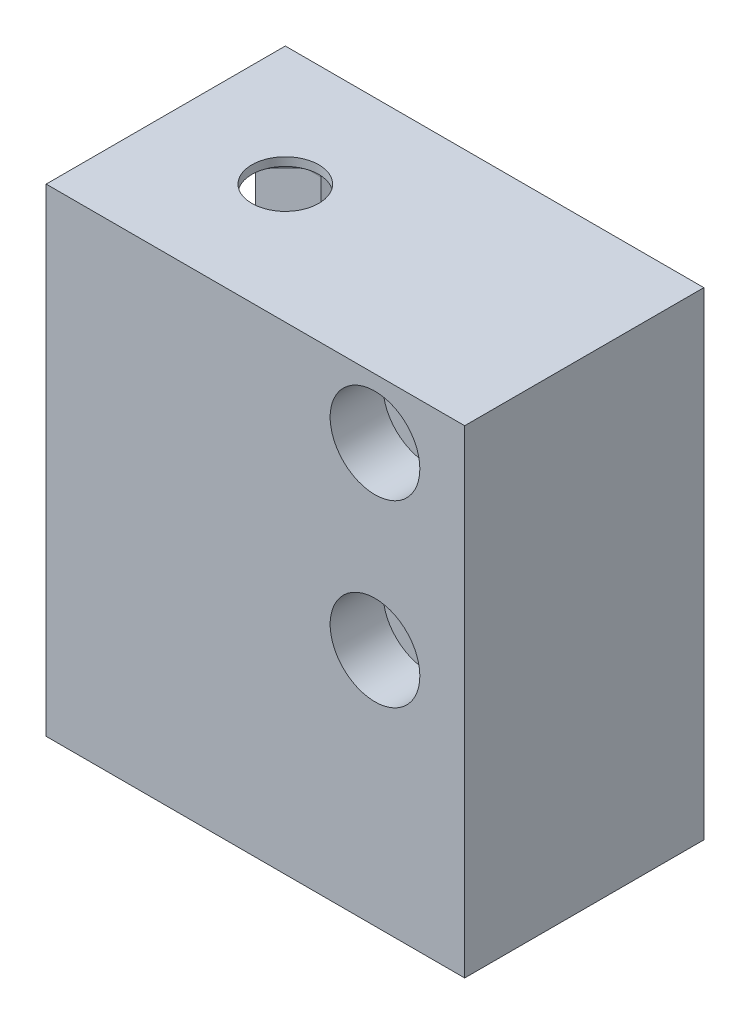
ISO-10303-21;
HEADER;
FILE_DESCRIPTION(('STEP AP214'),'2;1');
FILE_NAME('part.step','',(''),(''),'','','');
FILE_SCHEMA(('AUTOMOTIVE_DESIGN { 1 0 10303 214 1 1 1 1 }'));
ENDSEC;
DATA;
#1=APPLICATION_CONTEXT('core data for automotive mechanical design processes');
#2=APPLICATION_PROTOCOL_DEFINITION('international standard','automotive_design',2000,#1);
#3=PRODUCT_CONTEXT('',#1,'mechanical');
#4=PRODUCT('Part','Part','',(#3));
#5=PRODUCT_RELATED_PRODUCT_CATEGORY('part','',(#4));
#6=PRODUCT_DEFINITION_FORMATION('','',#4);
#7=PRODUCT_DEFINITION_CONTEXT('part definition',#1,'design');
#8=PRODUCT_DEFINITION('design','',#6,#7);
#9=PRODUCT_DEFINITION_SHAPE('','',#8);
#10=(LENGTH_UNIT() NAMED_UNIT(*) SI_UNIT(.MILLI.,.METRE.));
#11=(NAMED_UNIT(*) PLANE_ANGLE_UNIT() SI_UNIT($,.RADIAN.));
#12=(NAMED_UNIT(*) SI_UNIT($,.STERADIAN.) SOLID_ANGLE_UNIT());
#13=UNCERTAINTY_MEASURE_WITH_UNIT(LENGTH_MEASURE(1.E-05),#10,'distance_accuracy_value','');
#14=(GEOMETRIC_REPRESENTATION_CONTEXT(3) GLOBAL_UNCERTAINTY_ASSIGNED_CONTEXT((#13)) GLOBAL_UNIT_ASSIGNED_CONTEXT((#10,
#11,#12)) REPRESENTATION_CONTEXT('',''));
#15=CARTESIAN_POINT('',(0.,0.,0.));
#16=DIRECTION('',(0.,0.,1.));
#17=DIRECTION('',(1.,0.,0.));
#18=AXIS2_PLACEMENT_3D('',#15,#16,#17);
#19=CARTESIAN_POINT('',(22.225,50.8,12.7));
#20=DIRECTION('',(-1.,0.,0.));
#21=DIRECTION('',(0.,0.,1.));
#22=AXIS2_PLACEMENT_3D('',#19,#20,#21);
#23=PLANE('',#22);
#24=DIRECTION('',(0.,0.,-1.));
#25=VECTOR('',#24,1.);
#26=CARTESIAN_POINT('',(22.225,0.,12.7));
#27=LINE('',#26,#25);
#28=CARTESIAN_POINT('',(22.225,0.,12.7));
#29=VERTEX_POINT('',#28);
#30=CARTESIAN_POINT('',(22.225,0.,-12.7));
#31=VERTEX_POINT('',#30);
#32=EDGE_CURVE('E225',#29,#31,#27,.T.);
#33=ORIENTED_EDGE('',*,*,#32,.T.);
#34=DIRECTION('',(0.,-1.,0.));
#35=VECTOR('',#34,1.);
#36=CARTESIAN_POINT('',(22.225,50.8,-12.7));
#37=LINE('',#36,#35);
#38=CARTESIAN_POINT('',(22.225,50.8,-12.7));
#39=VERTEX_POINT('',#38);
#40=EDGE_CURVE('E171',#39,#31,#37,.T.);
#41=ORIENTED_EDGE('',*,*,#40,.F.);
#42=DIRECTION('',(0.,0.,-1.));
#43=VECTOR('',#42,1.);
#44=CARTESIAN_POINT('',(22.225,50.8,12.7));
#45=LINE('',#44,#43);
#46=CARTESIAN_POINT('',(22.225,50.8,12.7));
#47=VERTEX_POINT('',#46);
#48=EDGE_CURVE('E157',#47,#39,#45,.T.);
#49=ORIENTED_EDGE('',*,*,#48,.F.);
#50=DIRECTION('',(0.,-1.,0.));
#51=VECTOR('',#50,1.);
#52=CARTESIAN_POINT('',(22.225,50.8,12.7));
#53=LINE('',#52,#51);
#54=EDGE_CURVE('E163',#47,#29,#53,.T.);
#55=ORIENTED_EDGE('',*,*,#54,.T.);
#56=EDGE_LOOP('',(#33,#41,#49,#55));
#57=FACE_BOUND('',#56,.T.);
#58=ADVANCED_FACE('F32',(#57),#23,.F.);
#59=CARTESIAN_POINT('',(-22.225,50.8,-12.7));
#60=DIRECTION('',(0.,0.,1.));
#61=DIRECTION('',(1.,0.,0.));
#62=AXIS2_PLACEMENT_3D('',#59,#60,#61);
#63=PLANE('',#62);
#64=CARTESIAN_POINT('',(12.7,44.45,-12.7));
#65=DIRECTION('',(0.,0.,-1.));
#66=DIRECTION('',(-1.,0.,0.));
#67=AXIS2_PLACEMENT_3D('',#64,#65,#66);
#68=CIRCLE('',#67,4.76249999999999);
#69=CARTESIAN_POINT('',(7.9375,44.45,-12.7));
#70=VERTEX_POINT('',#69);
#71=EDGE_CURVE('E302',#70,#70,#68,.T.);
#72=ORIENTED_EDGE('',*,*,#71,.F.);
#73=EDGE_LOOP('',(#72));
#74=FACE_BOUND('',#73,.T.);
#75=CARTESIAN_POINT('',(12.7,25.4,-12.7));
#76=DIRECTION('',(0.,0.,-1.));
#77=DIRECTION('',(-1.,0.,0.));
#78=AXIS2_PLACEMENT_3D('',#75,#76,#77);
#79=CIRCLE('',#78,4.76249999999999);
#80=CARTESIAN_POINT('',(7.9375,25.4,-12.7));
#81=VERTEX_POINT('',#80);
#82=EDGE_CURVE('E293',#81,#81,#79,.T.);
#83=ORIENTED_EDGE('',*,*,#82,.F.);
#84=EDGE_LOOP('',(#83));
#85=FACE_BOUND('',#84,.T.);
#86=DIRECTION('',(-1.,0.,0.));
#87=VECTOR('',#86,1.);
#88=CARTESIAN_POINT('',(-22.225,0.,-12.7));
#89=LINE('',#88,#87);
#90=CARTESIAN_POINT('',(-22.225,0.,-12.7));
#91=VERTEX_POINT('',#90);
#92=EDGE_CURVE('E159',#31,#91,#89,.T.);
#93=ORIENTED_EDGE('',*,*,#92,.T.);
#94=DIRECTION('',(0.,-1.,0.));
#95=VECTOR('',#94,1.);
#96=CARTESIAN_POINT('',(-22.225,50.8,-12.7));
#97=LINE('',#96,#95);
#98=CARTESIAN_POINT('',(-22.225,50.8,-12.7));
#99=VERTEX_POINT('',#98);
#100=EDGE_CURVE('E153',#99,#91,#97,.T.);
#101=ORIENTED_EDGE('',*,*,#100,.F.);
#102=DIRECTION('',(-1.,0.,0.));
#103=VECTOR('',#102,1.);
#104=CARTESIAN_POINT('',(-22.225,50.8,-12.7));
#105=LINE('',#104,#103);
#106=EDGE_CURVE('E237',#39,#99,#105,.T.);
#107=ORIENTED_EDGE('',*,*,#106,.F.);
#108=ORIENTED_EDGE('',*,*,#40,.T.);
#109=EDGE_LOOP('',(#93,#101,#107,#108));
#110=FACE_BOUND('',#109,.T.);
#111=ADVANCED_FACE('F216',(#74,#85,#110),#63,.F.);
#112=CARTESIAN_POINT('',(-22.225,50.8,12.7));
#113=DIRECTION('',(1.,0.,0.));
#114=DIRECTION('',(0.,0.,-1.));
#115=AXIS2_PLACEMENT_3D('',#112,#113,#114);
#116=PLANE('',#115);
#117=DIRECTION('',(0.,0.,-1.));
#118=VECTOR('',#117,1.);
#119=CARTESIAN_POINT('',(-22.225,44.45,-9.525));
#120=LINE('',#119,#118);
#121=CARTESIAN_POINT('',(-22.225,44.45,8.89));
#122=VERTEX_POINT('',#121);
#123=CARTESIAN_POINT('',(-22.225,44.45,-8.89));
#124=VERTEX_POINT('',#123);
#125=EDGE_CURVE('E146',#122,#124,#120,.T.);
#126=ORIENTED_EDGE('',*,*,#125,.F.);
#127=CARTESIAN_POINT('',(-22.225,43.815,8.89));
#128=DIRECTION('',(1.,0.,0.));
#129=DIRECTION('',(0.,0.,-1.));
#130=AXIS2_PLACEMENT_3D('',#127,#128,#129);
#131=CIRCLE('',#130,0.635);
#132=CARTESIAN_POINT('',(-22.225,43.815,9.525));
#133=VERTEX_POINT('',#132);
#134=EDGE_CURVE('E190',#122,#133,#131,.T.);
#135=ORIENTED_EDGE('',*,*,#134,.T.);
#136=DIRECTION('',(0.,1.,0.));
#137=VECTOR('',#136,1.);
#138=CARTESIAN_POINT('',(-22.225,0.,9.52500000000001));
#139=LINE('',#138,#137);
#140=CARTESIAN_POINT('',(-22.225,0.,9.52500000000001));
#141=VERTEX_POINT('',#140);
#142=EDGE_CURVE('E134',#141,#133,#139,.T.);
#143=ORIENTED_EDGE('',*,*,#142,.F.);
#144=DIRECTION('',(0.,0.,1.));
#145=VECTOR('',#144,1.);
#146=CARTESIAN_POINT('',(-22.225,0.,12.7));
#147=LINE('',#146,#145);
#148=CARTESIAN_POINT('',(-22.225,0.,12.7));
#149=VERTEX_POINT('',#148);
#150=EDGE_CURVE('E155',#141,#149,#147,.T.);
#151=ORIENTED_EDGE('',*,*,#150,.T.);
#152=DIRECTION('',(0.,-1.,0.));
#153=VECTOR('',#152,1.);
#154=CARTESIAN_POINT('',(-22.225,50.8,12.7));
#155=LINE('',#154,#153);
#156=CARTESIAN_POINT('',(-22.225,50.8,12.7));
#157=VERTEX_POINT('',#156);
#158=EDGE_CURVE('E166',#157,#149,#155,.T.);
#159=ORIENTED_EDGE('',*,*,#158,.F.);
#160=DIRECTION('',(0.,0.,1.));
#161=VECTOR('',#160,1.);
#162=CARTESIAN_POINT('',(-22.225,50.8,12.7));
#163=LINE('',#162,#161);
#164=EDGE_CURVE('E235',#99,#157,#163,.T.);
#165=ORIENTED_EDGE('',*,*,#164,.F.);
#166=ORIENTED_EDGE('',*,*,#100,.T.);
#167=CARTESIAN_POINT('',(-22.225,0.,-9.525));
#168=VERTEX_POINT('',#167);
#169=EDGE_CURVE('E142',#91,#168,#147,.T.);
#170=ORIENTED_EDGE('',*,*,#169,.T.);
#171=DIRECTION('',(0.,-1.,0.));
#172=VECTOR('',#171,1.);
#173=CARTESIAN_POINT('',(-22.225,0.,-9.525));
#174=LINE('',#173,#172);
#175=CARTESIAN_POINT('',(-22.225,43.815,-9.525));
#176=VERTEX_POINT('',#175);
#177=EDGE_CURVE('E127',#176,#168,#174,.T.);
#178=ORIENTED_EDGE('',*,*,#177,.F.);
#179=CARTESIAN_POINT('',(-22.225,43.815,-8.89));
#180=DIRECTION('',(1.,0.,0.));
#181=DIRECTION('',(0.,0.,-1.));
#182=AXIS2_PLACEMENT_3D('',#179,#180,#181);
#183=CIRCLE('',#182,0.635);
#184=EDGE_CURVE('E44',#176,#124,#183,.T.);
#185=ORIENTED_EDGE('',*,*,#184,.T.);
#186=EDGE_LOOP('',(#126,#135,#143,#151,#159,#165,#166,#170,#178,#185));
#187=FACE_BOUND('',#186,.T.);
#188=ADVANCED_FACE('F150',(#187),#116,.F.);
#189=CARTESIAN_POINT('',(-22.225,50.8,12.7));
#190=DIRECTION('',(0.,0.,-1.));
#191=DIRECTION('',(-1.,0.,0.));
#192=AXIS2_PLACEMENT_3D('',#189,#190,#191);
#193=PLANE('',#192);
#194=CARTESIAN_POINT('',(12.7,25.4,12.7));
#195=DIRECTION('',(0.,0.,1.));
#196=DIRECTION('',(1.,0.,0.));
#197=AXIS2_PLACEMENT_3D('',#194,#195,#196);
#198=CIRCLE('',#197,4.76249999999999);
#199=CARTESIAN_POINT('',(17.4625,25.4,12.7));
#200=VERTEX_POINT('',#199);
#201=EDGE_CURVE('E284',#200,#200,#198,.T.);
#202=ORIENTED_EDGE('',*,*,#201,.F.);
#203=EDGE_LOOP('',(#202));
#204=FACE_BOUND('',#203,.T.);
#205=CARTESIAN_POINT('',(12.7,44.45,12.7));
#206=DIRECTION('',(0.,0.,1.));
#207=DIRECTION('',(1.,0.,0.));
#208=AXIS2_PLACEMENT_3D('',#205,#206,#207);
#209=CIRCLE('',#208,4.76249999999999);
#210=CARTESIAN_POINT('',(17.4625,44.45,12.7));
#211=VERTEX_POINT('',#210);
#212=EDGE_CURVE('E275',#211,#211,#209,.T.);
#213=ORIENTED_EDGE('',*,*,#212,.F.);
#214=EDGE_LOOP('',(#213));
#215=FACE_BOUND('',#214,.T.);
#216=DIRECTION('',(1.,0.,0.));
#217=VECTOR('',#216,1.);
#218=CARTESIAN_POINT('',(-22.225,0.,12.7));
#219=LINE('',#218,#217);
#220=EDGE_CURVE('E154',#149,#29,#219,.T.);
#221=ORIENTED_EDGE('',*,*,#220,.T.);
#222=ORIENTED_EDGE('',*,*,#54,.F.);
#223=DIRECTION('',(1.,0.,0.));
#224=VECTOR('',#223,1.);
#225=CARTESIAN_POINT('',(-22.225,50.8,12.7));
#226=LINE('',#225,#224);
#227=EDGE_CURVE('E167',#157,#47,#226,.T.);
#228=ORIENTED_EDGE('',*,*,#227,.F.);
#229=ORIENTED_EDGE('',*,*,#158,.T.);
#230=EDGE_LOOP('',(#221,#222,#228,#229));
#231=FACE_BOUND('',#230,.T.);
#232=ADVANCED_FACE('F389',(#204,#215,#231),#193,.F.);
#233=CARTESIAN_POINT('',(22.225,50.8,-12.7));
#234=DIRECTION('',(0.,-1.,0.));
#235=DIRECTION('',(0.,0.,-1.));
#236=AXIS2_PLACEMENT_3D('',#233,#234,#235);
#237=PLANE('',#236);
#238=CARTESIAN_POINT('',(-9.52500000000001,50.8,0.));
#239=DIRECTION('',(0.,-1.,0.));
#240=DIRECTION('',(0.,0.,-1.));
#241=AXIS2_PLACEMENT_3D('',#238,#239,#240);
#242=CIRCLE('',#241,3.556);
#243=CARTESIAN_POINT('',(-9.52500000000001,50.8,-3.556));
#244=VERTEX_POINT('',#243);
#245=EDGE_CURVE('E305',#244,#244,#242,.T.);
#246=ORIENTED_EDGE('',*,*,#245,.T.);
#247=EDGE_LOOP('',(#246));
#248=FACE_BOUND('',#247,.T.);
#249=ORIENTED_EDGE('',*,*,#48,.T.);
#250=ORIENTED_EDGE('',*,*,#106,.T.);
#251=ORIENTED_EDGE('',*,*,#164,.T.);
#252=ORIENTED_EDGE('',*,*,#227,.T.);
#253=EDGE_LOOP('',(#249,#250,#251,#252));
#254=FACE_BOUND('',#253,.T.);
#255=ADVANCED_FACE('F312',(#248,#254),#237,.F.);
#256=CARTESIAN_POINT('',(22.225,0.,-12.7));
#257=DIRECTION('',(0.,-1.,0.));
#258=DIRECTION('',(0.,0.,-1.));
#259=AXIS2_PLACEMENT_3D('',#256,#257,#258);
#260=PLANE('',#259);
#261=DIRECTION('',(-1.,0.,0.));
#262=VECTOR('',#261,1.);
#263=CARTESIAN_POINT('',(22.226,0.,9.52500000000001));
#264=LINE('',#263,#262);
#265=CARTESIAN_POINT('',(-15.2488126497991,0.,9.52500000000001));
#266=VERTEX_POINT('',#265);
#267=EDGE_CURVE('E145',#266,#141,#264,.T.);
#268=ORIENTED_EDGE('',*,*,#267,.F.);
#269=CARTESIAN_POINT('',(-9.52500000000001,0.,0.));
#270=DIRECTION('',(0.,-1.,0.));
#271=DIRECTION('',(0.,0.,-1.));
#272=AXIS2_PLACEMENT_3D('',#269,#270,#271);
#273=CIRCLE('',#272,11.1125);
#274=CARTESIAN_POINT('',(1.14974476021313,0.,3.08828116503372));
#275=VERTEX_POINT('',#274);
#276=EDGE_CURVE('E255',#275,#266,#273,.T.);
#277=ORIENTED_EDGE('',*,*,#276,.F.);
#278=CARTESIAN_POINT('',(4.77519999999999,0.,0.));
#279=DIRECTION('',(0.,-1.,0.));
#280=DIRECTION('',(0.,0.,-1.));
#281=AXIS2_PLACEMENT_3D('',#278,#279,#280);
#282=CIRCLE('',#281,4.7625);
#283=CARTESIAN_POINT('',(1.14974476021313,0.,-3.08828116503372));
#284=VERTEX_POINT('',#283);
#285=EDGE_CURVE('E231',#284,#275,#282,.T.);
#286=ORIENTED_EDGE('',*,*,#285,.F.);
#287=CARTESIAN_POINT('',(-15.2488126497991,0.,-9.525));
#288=VERTEX_POINT('',#287);
#289=EDGE_CURVE('E144',#288,#284,#273,.T.);
#290=ORIENTED_EDGE('',*,*,#289,.F.);
#291=DIRECTION('',(-1.,0.,0.));
#292=VECTOR('',#291,1.);
#293=CARTESIAN_POINT('',(22.226,0.,-9.525));
#294=LINE('',#293,#292);
#295=EDGE_CURVE('E130',#288,#168,#294,.T.);
#296=ORIENTED_EDGE('',*,*,#295,.T.);
#297=ORIENTED_EDGE('',*,*,#169,.F.);
#298=ORIENTED_EDGE('',*,*,#92,.F.);
#299=ORIENTED_EDGE('',*,*,#32,.F.);
#300=ORIENTED_EDGE('',*,*,#220,.F.);
#301=ORIENTED_EDGE('',*,*,#150,.F.);
#302=EDGE_LOOP('',(#268,#277,#286,#290,#296,#297,#298,#299,#300,#301));
#303=FACE_BOUND('',#302,.T.);
#304=ADVANCED_FACE('F141',(#303),#260,.T.);
#305=CARTESIAN_POINT('',(4.77519999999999,3.175,0.));
#306=DIRECTION('',(0.,-1.,0.));
#307=DIRECTION('',(0.,0.,-1.));
#308=AXIS2_PLACEMENT_3D('',#305,#306,#307);
#309=CYLINDRICAL_SURFACE('',#308,4.7625);
#310=CARTESIAN_POINT('',(4.77519999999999,3.175,0.));
#311=DIRECTION('',(0.,-1.,0.));
#312=DIRECTION('',(0.,0.,-1.));
#313=AXIS2_PLACEMENT_3D('',#310,#311,#312);
#314=CIRCLE('',#313,4.7625);
#315=CARTESIAN_POINT('',(1.14974476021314,3.175,-3.08828116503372));
#316=VERTEX_POINT('',#315);
#317=CARTESIAN_POINT('',(1.14974476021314,3.175,3.08828116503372));
#318=VERTEX_POINT('',#317);
#319=EDGE_CURVE('E229',#316,#318,#314,.T.);
#320=ORIENTED_EDGE('',*,*,#319,.F.);
#321=DIRECTION('',(0.,-1.,0.));
#322=VECTOR('',#321,1.);
#323=CARTESIAN_POINT('',(1.14974476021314,24.9555,-3.08828116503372));
#324=LINE('',#323,#322);
#325=EDGE_CURVE('E249',#316,#284,#324,.T.);
#326=ORIENTED_EDGE('',*,*,#325,.T.);
#327=ORIENTED_EDGE('',*,*,#285,.T.);
#328=DIRECTION('',(0.,-1.,0.));
#329=VECTOR('',#328,1.);
#330=CARTESIAN_POINT('',(1.14974476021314,24.9555,3.08828116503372));
#331=LINE('',#330,#329);
#332=EDGE_CURVE('E252',#275,#318,#331,.F.);
#333=ORIENTED_EDGE('',*,*,#332,.T.);
#334=EDGE_LOOP('',(#320,#326,#327,#333));
#335=FACE_BOUND('',#334,.T.);
#336=ADVANCED_FACE('F399',(#335),#309,.F.);
#337=CARTESIAN_POINT('',(4.77519999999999,3.175,0.));
#338=DIRECTION('',(0.,-1.,0.));
#339=DIRECTION('',(0.,0.,-1.));
#340=AXIS2_PLACEMENT_3D('',#337,#338,#339);
#341=PLANE('',#340);
#342=CARTESIAN_POINT('',(-9.52500000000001,3.175,0.));
#343=DIRECTION('',(0.,-1.,0.));
#344=DIRECTION('',(0.,0.,-1.));
#345=AXIS2_PLACEMENT_3D('',#342,#343,#344);
#346=CIRCLE('',#345,11.1125);
#347=EDGE_CURVE('E174',#316,#318,#346,.T.);
#348=ORIENTED_EDGE('',*,*,#347,.F.);
#349=ORIENTED_EDGE('',*,*,#319,.T.);
#350=EDGE_LOOP('',(#348,#349));
#351=FACE_BOUND('',#350,.T.);
#352=CARTESIAN_POINT('',(4.77519999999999,3.175,0.));
#353=DIRECTION('',(0.,-1.,0.));
#354=DIRECTION('',(0.,0.,-1.));
#355=AXIS2_PLACEMENT_3D('',#352,#353,#354);
#356=CIRCLE('',#355,2.413);
#357=CARTESIAN_POINT('',(4.77519999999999,3.175,-2.413));
#358=VERTEX_POINT('',#357);
#359=EDGE_CURVE('E246',#358,#358,#356,.T.);
#360=ORIENTED_EDGE('',*,*,#359,.F.);
#361=EDGE_LOOP('',(#360));
#362=FACE_BOUND('',#361,.T.);
#363=ADVANCED_FACE('F402',(#351,#362),#341,.T.);
#364=CARTESIAN_POINT('',(4.77519999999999,17.399,0.));
#365=DIRECTION('',(0.,-1.,0.));
#366=DIRECTION('',(0.,0.,-1.));
#367=AXIS2_PLACEMENT_3D('',#364,#365,#366);
#368=CONICAL_SURFACE('',#367,2.413,1.02974425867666);
#369=CARTESIAN_POINT('',(4.77519999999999,18.8488766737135,0.));
#370=VERTEX_POINT('',#369);
#371=VERTEX_LOOP('',#370);
#372=FACE_BOUND('',#371,.T.);
#373=CARTESIAN_POINT('',(4.77519999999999,17.399,0.));
#374=DIRECTION('',(0.,-1.,0.));
#375=DIRECTION('',(0.,0.,-1.));
#376=AXIS2_PLACEMENT_3D('',#373,#374,#375);
#377=CIRCLE('',#376,2.413);
#378=CARTESIAN_POINT('',(4.77519999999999,17.399,-2.413));
#379=VERTEX_POINT('',#378);
#380=EDGE_CURVE('E242',#379,#379,#377,.T.);
#381=ORIENTED_EDGE('',*,*,#380,.T.);
#382=EDGE_LOOP('',(#381));
#383=FACE_BOUND('',#382,.T.);
#384=ADVANCED_FACE('F405',(#372,#383),#368,.F.);
#385=CARTESIAN_POINT('',(4.77519999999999,3.175,0.));
#386=DIRECTION('',(0.,-1.,0.));
#387=DIRECTION('',(0.,0.,-1.));
#388=AXIS2_PLACEMENT_3D('',#385,#386,#387);
#389=CYLINDRICAL_SURFACE('',#388,2.413);
#390=ORIENTED_EDGE('',*,*,#380,.F.);
#391=EDGE_LOOP('',(#390));
#392=FACE_BOUND('',#391,.T.);
#393=ORIENTED_EDGE('',*,*,#359,.T.);
#394=EDGE_LOOP('',(#393));
#395=FACE_BOUND('',#394,.T.);
#396=ADVANCED_FACE('F332',(#392,#395),#389,.F.);
#397=CARTESIAN_POINT('',(-9.52500000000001,49.911,0.));
#398=DIRECTION('',(0.,-1.,0.));
#399=DIRECTION('',(0.,0.,-1.));
#400=AXIS2_PLACEMENT_3D('',#397,#398,#399);
#401=CYLINDRICAL_SURFACE('',#400,11.1125);
#402=CARTESIAN_POINT('',(-9.52500000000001,49.276,0.));
#403=DIRECTION('',(0.,-1.,0.));
#404=DIRECTION('',(0.,0.,-1.));
#405=AXIS2_PLACEMENT_3D('',#402,#403,#404);
#406=CIRCLE('',#405,11.1125);
#407=CARTESIAN_POINT('',(-9.52500000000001,49.276,-11.1125));
#408=VERTEX_POINT('',#407);
#409=EDGE_CURVE('E187',#408,#408,#406,.F.);
#410=ORIENTED_EDGE('',*,*,#409,.T.);
#411=EDGE_LOOP('',(#410));
#412=FACE_BOUND('',#411,.T.);
#413=ORIENTED_EDGE('',*,*,#276,.T.);
#414=DIRECTION('',(0.,-1.,0.));
#415=VECTOR('',#414,1.);
#416=CARTESIAN_POINT('',(-15.2488126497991,49.911,9.525));
#417=LINE('',#416,#415);
#418=CARTESIAN_POINT('',(-15.2488126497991,43.815,9.525));
#419=VERTEX_POINT('',#418);
#420=EDGE_CURVE('E265',#419,#266,#417,.T.);
#421=ORIENTED_EDGE('',*,*,#420,.F.);
#422=CARTESIAN_POINT('',(-15.2488126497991,43.815,9.525));
#423=CARTESIAN_POINT('',(-15.2487686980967,43.8348857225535,9.52502473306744));
#424=CARTESIAN_POINT('',(-15.2503650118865,43.8547064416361,9.524067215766));
#425=CARTESIAN_POINT('',(-15.2564333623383,43.8935254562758,9.52041744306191));
#426=CARTESIAN_POINT('',(-15.2608739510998,43.9125303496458,9.51774415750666));
#427=CARTESIAN_POINT('',(-15.2736147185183,43.9539417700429,9.5100551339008));
#428=CARTESIAN_POINT('',(-15.2825881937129,43.9760607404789,9.50462948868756));
#429=CARTESIAN_POINT('',(-15.3034557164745,44.0183788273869,9.4919574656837));
#430=CARTESIAN_POINT('',(-15.3153629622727,44.038568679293,9.4847028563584));
#431=CARTESIAN_POINT('',(-15.3484722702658,44.0875864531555,9.46442700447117));
#432=CARTESIAN_POINT('',(-15.3711663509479,44.1149934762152,9.45043922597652));
#433=CARTESIAN_POINT('',(-15.4196090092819,44.1655346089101,9.4203005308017));
#434=CARTESIAN_POINT('',(-15.4453638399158,44.1886597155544,9.40414517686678));
#435=CARTESIAN_POINT('',(-15.4957422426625,44.2288351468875,9.37222917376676));
#436=CARTESIAN_POINT('',(-15.5201620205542,44.2462771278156,9.35663212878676));
#437=CARTESIAN_POINT('',(-15.5700344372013,44.278642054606,9.32448920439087));
#438=CARTESIAN_POINT('',(-15.5954878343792,44.293563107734,9.30794262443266));
#439=CARTESIAN_POINT('',(-15.6730432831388,44.335021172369,9.25705309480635));
#440=CARTESIAN_POINT('',(-15.7262176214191,44.3581608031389,9.22153791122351));
#441=CARTESIAN_POINT('',(-15.8141576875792,44.3895570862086,9.16165257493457));
#442=CARTESIAN_POINT('',(-15.8485789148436,44.4001652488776,9.13793114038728));
#443=CARTESIAN_POINT('',(-15.9177061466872,44.4183303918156,9.08970499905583));
#444=CARTESIAN_POINT('',(-15.9524122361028,44.4258864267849,9.06520005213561));
#445=CARTESIAN_POINT('',(-16.021441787,44.4379145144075,9.01585695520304));
#446=CARTESIAN_POINT('',(-16.0557645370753,44.4424243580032,8.99102693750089));
#447=CARTESIAN_POINT('',(-16.1242727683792,44.4484598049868,8.94086491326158));
#448=CARTESIAN_POINT('',(-16.1584583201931,44.4499872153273,8.91553322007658));
#449=CARTESIAN_POINT('',(-16.1925,44.45,8.89));
#450=B_SPLINE_CURVE_WITH_KNOTS('',3,(#422,#423,#424,#425,#426,#427,#428,#429,#430,#431,#432,
#433,#434,#435,#436,#437,#438,#439,#440,#441,#442,#443,#444,#445,#446,#447,#448,#449),
.UNSPECIFIED.,.F.,.F.,(4,2,2,2,2,2,2,2,2,2,2,2,2,4),(0.,0.0594650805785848,0.118283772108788,
0.191313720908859,0.264678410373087,0.378739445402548,0.493037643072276,0.594353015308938,
0.695744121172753,0.899037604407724,1.02833378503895,1.1576699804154,1.28537062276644,
1.41299387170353),.UNSPECIFIED.);
#451=CARTESIAN_POINT('',(-16.1925,44.45,8.89));
#452=VERTEX_POINT('',#451);
#453=EDGE_CURVE('E192',#419,#452,#450,.T.);
#454=ORIENTED_EDGE('',*,*,#453,.T.);
#455=CARTESIAN_POINT('',(-9.52500000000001,44.45,0.));
#456=DIRECTION('',(0.,1.,0.));
#457=DIRECTION('',(0.,0.,1.));
#458=AXIS2_PLACEMENT_3D('',#455,#456,#457);
#459=CIRCLE('',#458,11.1125);
#460=CARTESIAN_POINT('',(-16.1925,44.45,-8.89));
#461=VERTEX_POINT('',#460);
#462=EDGE_CURVE('E264',#461,#452,#459,.T.);
#463=ORIENTED_EDGE('',*,*,#462,.F.);
#464=CARTESIAN_POINT('',(-16.1925,44.45,-8.89));
#465=CARTESIAN_POINT('',(-16.1523787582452,44.4499750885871,-8.92009497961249));
#466=CARTESIAN_POINT('',(-16.1120540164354,44.4478599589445,-8.94991019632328));
#467=CARTESIAN_POINT('',(-16.0312183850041,44.4394972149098,-9.00884373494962));
#468=CARTESIAN_POINT('',(-15.9907072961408,44.4332426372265,-9.03796079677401));
#469=CARTESIAN_POINT('',(-15.9095256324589,44.4165813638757,-9.09549278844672));
#470=CARTESIAN_POINT('',(-15.8688564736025,44.4061410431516,-9.12390000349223));
#471=CARTESIAN_POINT('',(-15.7880840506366,44.3809749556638,-9.1795334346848));
#472=CARTESIAN_POINT('',(-15.7479802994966,44.3662531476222,-9.20676071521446));
#473=CARTESIAN_POINT('',(-15.6688830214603,44.3322173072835,-9.25973100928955));
#474=CARTESIAN_POINT('',(-15.6298871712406,44.3129138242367,-9.2854772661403));
#475=CARTESIAN_POINT('',(-15.5537039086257,44.2690832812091,-9.33511865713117));
#476=CARTESIAN_POINT('',(-15.5165139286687,44.2445639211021,-9.35901644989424));
#477=CARTESIAN_POINT('',(-15.4539207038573,44.1959541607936,-9.3987543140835));
#478=CARTESIAN_POINT('',(-15.4278423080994,44.1731945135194,-9.41514523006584));
#479=CARTESIAN_POINT('',(-15.3786055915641,44.1234258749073,-9.44583453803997));
#480=CARTESIAN_POINT('',(-15.3554421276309,44.0964245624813,-9.46013662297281));
#481=CARTESIAN_POINT('',(-15.3219594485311,44.0489178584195,-9.48067221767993));
#482=CARTESIAN_POINT('',(-15.3101289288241,44.0299147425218,-9.48789200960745));
#483=CARTESIAN_POINT('',(-15.2890144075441,43.9901153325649,-9.50073388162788));
#484=CARTESIAN_POINT('',(-15.279719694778,43.9693270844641,-9.50636268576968));
#485=CARTESIAN_POINT('',(-15.2647178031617,43.9268613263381,-9.51542827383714));
#486=CARTESIAN_POINT('',(-15.2588952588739,43.9052413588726,-9.51893561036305));
#487=CARTESIAN_POINT('',(-15.2508802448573,43.860795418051,-9.52375774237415));
#488=CARTESIAN_POINT('',(-15.2487411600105,43.8379565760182,-9.52504029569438));
#489=CARTESIAN_POINT('',(-15.2488126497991,43.815,-9.525));
#490=B_SPLINE_CURVE_WITH_KNOTS('',3,(#464,#465,#466,#467,#468,#469,#470,#471,#472,#473,#474,
#475,#476,#477,#478,#479,#480,#481,#482,#483,#484,#485,#486,#487,#488,#489),.UNSPECIFIED.,.F.,
.F.,(4,2,2,2,2,2,2,2,2,2,2,2,4),(0.,0.150411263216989,0.301076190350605,0.452976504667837,
0.604736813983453,0.756151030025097,0.90734325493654,1.02196534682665,1.13638227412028,
1.2067411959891,1.27679815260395,1.34437474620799,1.41292274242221),.UNSPECIFIED.);
#491=CARTESIAN_POINT('',(-15.2488126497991,43.815,-9.525));
#492=VERTEX_POINT('',#491);
#493=EDGE_CURVE('E11',#461,#492,#490,.T.);
#494=ORIENTED_EDGE('',*,*,#493,.T.);
#495=DIRECTION('',(0.,-1.,0.));
#496=VECTOR('',#495,1.);
#497=CARTESIAN_POINT('',(-15.2488126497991,49.911,-9.525));
#498=LINE('',#497,#496);
#499=EDGE_CURVE('E135',#288,#492,#498,.F.);
#500=ORIENTED_EDGE('',*,*,#499,.F.);
#501=ORIENTED_EDGE('',*,*,#289,.T.);
#502=ORIENTED_EDGE('',*,*,#325,.F.);
#503=ORIENTED_EDGE('',*,*,#347,.T.);
#504=ORIENTED_EDGE('',*,*,#332,.F.);
#505=EDGE_LOOP('',(#413,#421,#454,#463,#494,#500,#501,#502,#503,#504));
#506=FACE_BOUND('',#505,.T.);
#507=ADVANCED_FACE('F197',(#412,#506),#401,.F.);
#508=CARTESIAN_POINT('',(-9.52500000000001,49.911,0.));
#509=DIRECTION('',(0.,-1.,0.));
#510=DIRECTION('',(0.,0.,-1.));
#511=AXIS2_PLACEMENT_3D('',#508,#509,#510);
#512=PLANE('',#511);
#513=CARTESIAN_POINT('',(-9.52500000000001,49.911,0.));
#514=DIRECTION('',(0.,-1.,0.));
#515=DIRECTION('',(0.,0.,-1.));
#516=AXIS2_PLACEMENT_3D('',#513,#514,#515);
#517=CIRCLE('',#516,10.4775);
#518=CARTESIAN_POINT('',(-9.52500000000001,49.911,-10.4775));
#519=VERTEX_POINT('',#518);
#520=EDGE_CURVE('E184',#519,#519,#517,.T.);
#521=ORIENTED_EDGE('',*,*,#520,.T.);
#522=EDGE_LOOP('',(#521));
#523=FACE_BOUND('',#522,.T.);
#524=CARTESIAN_POINT('',(-9.52500000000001,49.911,0.));
#525=DIRECTION('',(0.,-1.,0.));
#526=DIRECTION('',(0.,0.,-1.));
#527=AXIS2_PLACEMENT_3D('',#524,#525,#526);
#528=CIRCLE('',#527,3.556);
#529=CARTESIAN_POINT('',(-9.52500000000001,49.911,-3.556));
#530=VERTEX_POINT('',#529);
#531=EDGE_CURVE('E306',#530,#530,#528,.T.);
#532=ORIENTED_EDGE('',*,*,#531,.F.);
#533=EDGE_LOOP('',(#532));
#534=FACE_BOUND('',#533,.T.);
#535=ADVANCED_FACE('F321',(#523,#534),#512,.T.);
#536=CARTESIAN_POINT('',(22.226,0.,9.52500000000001));
#537=DIRECTION('',(0.,0.,1.));
#538=DIRECTION('',(0.,-1.,0.));
#539=AXIS2_PLACEMENT_3D('',#536,#537,#538);
#540=PLANE('',#539);
#541=ORIENTED_EDGE('',*,*,#142,.T.);
#542=DIRECTION('',(-1.,0.,0.));
#543=VECTOR('',#542,1.);
#544=CARTESIAN_POINT('',(-15.2488126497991,43.815,9.525));
#545=LINE('',#544,#543);
#546=EDGE_CURVE('E181',#133,#419,#545,.F.);
#547=ORIENTED_EDGE('',*,*,#546,.T.);
#548=ORIENTED_EDGE('',*,*,#420,.T.);
#549=ORIENTED_EDGE('',*,*,#267,.T.);
#550=EDGE_LOOP('',(#541,#547,#548,#549));
#551=FACE_BOUND('',#550,.T.);
#552=ADVANCED_FACE('F323',(#551),#540,.F.);
#553=CARTESIAN_POINT('',(22.226,44.45,-9.525));
#554=DIRECTION('',(0.,1.,0.));
#555=DIRECTION('',(0.,0.,1.));
#556=AXIS2_PLACEMENT_3D('',#553,#554,#555);
#557=PLANE('',#556);
#558=ORIENTED_EDGE('',*,*,#462,.T.);
#559=DIRECTION('',(-1.,0.,0.));
#560=VECTOR('',#559,1.);
#561=CARTESIAN_POINT('',(-22.225,44.45,8.89));
#562=LINE('',#561,#560);
#563=EDGE_CURVE('E178',#452,#122,#562,.T.);
#564=ORIENTED_EDGE('',*,*,#563,.T.);
#565=ORIENTED_EDGE('',*,*,#125,.T.);
#566=DIRECTION('',(-1.,0.,0.));
#567=VECTOR('',#566,1.);
#568=CARTESIAN_POINT('',(-15.2488126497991,44.45,-8.89));
#569=LINE('',#568,#567);
#570=EDGE_CURVE('E176',#124,#461,#569,.F.);
#571=ORIENTED_EDGE('',*,*,#570,.T.);
#572=EDGE_LOOP('',(#558,#564,#565,#571));
#573=FACE_BOUND('',#572,.T.);
#574=ADVANCED_FACE('F329',(#573),#557,.F.);
#575=CARTESIAN_POINT('',(22.226,0.,-9.525));
#576=DIRECTION('',(0.,0.,-1.));
#577=DIRECTION('',(-1.,0.,0.));
#578=AXIS2_PLACEMENT_3D('',#575,#576,#577);
#579=PLANE('',#578);
#580=ORIENTED_EDGE('',*,*,#499,.T.);
#581=DIRECTION('',(-1.,0.,0.));
#582=VECTOR('',#581,1.);
#583=CARTESIAN_POINT('',(-22.225,43.815,-9.525));
#584=LINE('',#583,#582);
#585=EDGE_CURVE('E131',#492,#176,#584,.T.);
#586=ORIENTED_EDGE('',*,*,#585,.T.);
#587=ORIENTED_EDGE('',*,*,#177,.T.);
#588=ORIENTED_EDGE('',*,*,#295,.F.);
#589=EDGE_LOOP('',(#580,#586,#587,#588));
#590=FACE_BOUND('',#589,.T.);
#591=ADVANCED_FACE('F129',(#590),#579,.F.);
#592=CARTESIAN_POINT('',(12.7,44.45,12.7));
#593=DIRECTION('',(0.,0.,1.));
#594=DIRECTION('',(1.,0.,0.));
#595=AXIS2_PLACEMENT_3D('',#592,#593,#594);
#596=CYLINDRICAL_SURFACE('',#595,2.5527);
#597=CARTESIAN_POINT('',(12.7,44.45,7.0866));
#598=DIRECTION('',(0.,0.,1.));
#599=DIRECTION('',(1.,0.,0.));
#600=AXIS2_PLACEMENT_3D('',#597,#598,#599);
#601=CIRCLE('',#600,2.5527);
#602=CARTESIAN_POINT('',(15.2527,44.45,7.0866));
#603=VERTEX_POINT('',#602);
#604=EDGE_CURVE('E267',#603,#603,#601,.T.);
#605=ORIENTED_EDGE('',*,*,#604,.T.);
#606=EDGE_LOOP('',(#605));
#607=FACE_BOUND('',#606,.T.);
#608=CARTESIAN_POINT('',(12.7,44.45,-6.29158));
#609=DIRECTION('',(0.,0.,-1.));
#610=DIRECTION('',(-1.,0.,0.));
#611=AXIS2_PLACEMENT_3D('',#608,#609,#610);
#612=CIRCLE('',#611,2.5527);
#613=CARTESIAN_POINT('',(10.1473,44.45,-6.29158));
#614=VERTEX_POINT('',#613);
#615=EDGE_CURVE('E296',#614,#614,#612,.T.);
#616=ORIENTED_EDGE('',*,*,#615,.T.);
#617=EDGE_LOOP('',(#616));
#618=FACE_BOUND('',#617,.T.);
#619=ADVANCED_FACE('F336',(#607,#618),#596,.F.);
#620=CARTESIAN_POINT('',(15.2527,44.45,7.0866));
#621=DIRECTION('',(0.,0.,-1.));
#622=DIRECTION('',(-1.,0.,0.));
#623=AXIS2_PLACEMENT_3D('',#620,#621,#622);
#624=PLANE('',#623);
#625=ORIENTED_EDGE('',*,*,#604,.F.);
#626=EDGE_LOOP('',(#625));
#627=FACE_BOUND('',#626,.T.);
#628=CARTESIAN_POINT('',(12.7,44.45,7.0866));
#629=DIRECTION('',(0.,0.,1.));
#630=DIRECTION('',(1.,0.,0.));
#631=AXIS2_PLACEMENT_3D('',#628,#629,#630);
#632=CIRCLE('',#631,4.7625);
#633=CARTESIAN_POINT('',(17.4625,44.45,7.0866));
#634=VERTEX_POINT('',#633);
#635=EDGE_CURVE('E272',#634,#634,#632,.T.);
#636=ORIENTED_EDGE('',*,*,#635,.T.);
#637=EDGE_LOOP('',(#636));
#638=FACE_BOUND('',#637,.T.);
#639=ADVANCED_FACE('F343',(#627,#638),#624,.F.);
#640=CARTESIAN_POINT('',(12.7,44.45,12.7));
#641=DIRECTION('',(0.,0.,1.));
#642=DIRECTION('',(1.,0.,0.));
#643=AXIS2_PLACEMENT_3D('',#640,#641,#642);
#644=CYLINDRICAL_SURFACE('',#643,4.7625);
#645=ORIENTED_EDGE('',*,*,#635,.F.);
#646=EDGE_LOOP('',(#645));
#647=FACE_BOUND('',#646,.T.);
#648=ORIENTED_EDGE('',*,*,#212,.T.);
#649=EDGE_LOOP('',(#648));
#650=FACE_BOUND('',#649,.T.);
#651=ADVANCED_FACE('F347',(#647,#650),#644,.F.);
#652=CARTESIAN_POINT('',(12.7,25.4,12.7));
#653=DIRECTION('',(0.,0.,1.));
#654=DIRECTION('',(1.,0.,0.));
#655=AXIS2_PLACEMENT_3D('',#652,#653,#654);
#656=CYLINDRICAL_SURFACE('',#655,2.5527);
#657=CARTESIAN_POINT('',(12.7,25.4,7.0866));
#658=DIRECTION('',(0.,0.,1.));
#659=DIRECTION('',(1.,0.,0.));
#660=AXIS2_PLACEMENT_3D('',#657,#658,#659);
#661=CIRCLE('',#660,2.5527);
#662=CARTESIAN_POINT('',(15.2527,25.4,7.0866));
#663=VERTEX_POINT('',#662);
#664=EDGE_CURVE('E278',#663,#663,#661,.T.);
#665=ORIENTED_EDGE('',*,*,#664,.T.);
#666=EDGE_LOOP('',(#665));
#667=FACE_BOUND('',#666,.T.);
#668=CARTESIAN_POINT('',(12.7,25.4,-6.29158));
#669=DIRECTION('',(0.,0.,-1.));
#670=DIRECTION('',(-1.,0.,0.));
#671=AXIS2_PLACEMENT_3D('',#668,#669,#670);
#672=CIRCLE('',#671,2.5527);
#673=CARTESIAN_POINT('',(10.1473,25.4,-6.29158));
#674=VERTEX_POINT('',#673);
#675=EDGE_CURVE('E287',#674,#674,#672,.T.);
#676=ORIENTED_EDGE('',*,*,#675,.T.);
#677=EDGE_LOOP('',(#676));
#678=FACE_BOUND('',#677,.T.);
#679=ADVANCED_FACE('F351',(#667,#678),#656,.F.);
#680=CARTESIAN_POINT('',(15.2527,25.4,7.0866));
#681=DIRECTION('',(0.,0.,-1.));
#682=DIRECTION('',(-1.,0.,0.));
#683=AXIS2_PLACEMENT_3D('',#680,#681,#682);
#684=PLANE('',#683);
#685=ORIENTED_EDGE('',*,*,#664,.F.);
#686=EDGE_LOOP('',(#685));
#687=FACE_BOUND('',#686,.T.);
#688=CARTESIAN_POINT('',(12.7,25.4,7.0866));
#689=DIRECTION('',(0.,0.,1.));
#690=DIRECTION('',(1.,0.,0.));
#691=AXIS2_PLACEMENT_3D('',#688,#689,#690);
#692=CIRCLE('',#691,4.7625);
#693=CARTESIAN_POINT('',(17.4625,25.4,7.0866));
#694=VERTEX_POINT('',#693);
#695=EDGE_CURVE('E281',#694,#694,#692,.T.);
#696=ORIENTED_EDGE('',*,*,#695,.T.);
#697=EDGE_LOOP('',(#696));
#698=FACE_BOUND('',#697,.T.);
#699=ADVANCED_FACE('F355',(#687,#698),#684,.F.);
#700=CARTESIAN_POINT('',(12.7,25.4,12.7));
#701=DIRECTION('',(0.,0.,1.));
#702=DIRECTION('',(1.,0.,0.));
#703=AXIS2_PLACEMENT_3D('',#700,#701,#702);
#704=CYLINDRICAL_SURFACE('',#703,4.7625);
#705=ORIENTED_EDGE('',*,*,#695,.F.);
#706=EDGE_LOOP('',(#705));
#707=FACE_BOUND('',#706,.T.);
#708=ORIENTED_EDGE('',*,*,#201,.T.);
#709=EDGE_LOOP('',(#708));
#710=FACE_BOUND('',#709,.T.);
#711=ADVANCED_FACE('F359',(#707,#710),#704,.F.);
#712=CARTESIAN_POINT('',(15.2527,25.4,-6.29158));
#713=DIRECTION('',(0.,0.,1.));
#714=DIRECTION('',(1.,0.,0.));
#715=AXIS2_PLACEMENT_3D('',#712,#713,#714);
#716=PLANE('',#715);
#717=ORIENTED_EDGE('',*,*,#675,.F.);
#718=EDGE_LOOP('',(#717));
#719=FACE_BOUND('',#718,.T.);
#720=CARTESIAN_POINT('',(12.7,25.4,-6.29158));
#721=DIRECTION('',(0.,0.,-1.));
#722=DIRECTION('',(-1.,0.,0.));
#723=AXIS2_PLACEMENT_3D('',#720,#721,#722);
#724=CIRCLE('',#723,4.7625);
#725=CARTESIAN_POINT('',(7.93749999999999,25.4,-6.29158));
#726=VERTEX_POINT('',#725);
#727=EDGE_CURVE('E290',#726,#726,#724,.T.);
#728=ORIENTED_EDGE('',*,*,#727,.T.);
#729=EDGE_LOOP('',(#728));
#730=FACE_BOUND('',#729,.T.);
#731=ADVANCED_FACE('F363',(#719,#730),#716,.F.);
#732=CARTESIAN_POINT('',(12.7,25.4,-12.7));
#733=DIRECTION('',(0.,0.,-1.));
#734=DIRECTION('',(-1.,0.,0.));
#735=AXIS2_PLACEMENT_3D('',#732,#733,#734);
#736=CYLINDRICAL_SURFACE('',#735,4.7625);
#737=ORIENTED_EDGE('',*,*,#727,.F.);
#738=EDGE_LOOP('',(#737));
#739=FACE_BOUND('',#738,.T.);
#740=ORIENTED_EDGE('',*,*,#82,.T.);
#741=EDGE_LOOP('',(#740));
#742=FACE_BOUND('',#741,.T.);
#743=ADVANCED_FACE('F367',(#739,#742),#736,.F.);
#744=CARTESIAN_POINT('',(15.2527,44.45,-6.29158));
#745=DIRECTION('',(0.,0.,1.));
#746=DIRECTION('',(1.,0.,0.));
#747=AXIS2_PLACEMENT_3D('',#744,#745,#746);
#748=PLANE('',#747);
#749=ORIENTED_EDGE('',*,*,#615,.F.);
#750=EDGE_LOOP('',(#749));
#751=FACE_BOUND('',#750,.T.);
#752=CARTESIAN_POINT('',(12.7,44.45,-6.29158));
#753=DIRECTION('',(0.,0.,-1.));
#754=DIRECTION('',(-1.,0.,0.));
#755=AXIS2_PLACEMENT_3D('',#752,#753,#754);
#756=CIRCLE('',#755,4.7625);
#757=CARTESIAN_POINT('',(7.93749999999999,44.45,-6.29158));
#758=VERTEX_POINT('',#757);
#759=EDGE_CURVE('E299',#758,#758,#756,.T.);
#760=ORIENTED_EDGE('',*,*,#759,.T.);
#761=EDGE_LOOP('',(#760));
#762=FACE_BOUND('',#761,.T.);
#763=ADVANCED_FACE('F371',(#751,#762),#748,.F.);
#764=CARTESIAN_POINT('',(12.7,44.45,-12.7));
#765=DIRECTION('',(0.,0.,-1.));
#766=DIRECTION('',(-1.,0.,0.));
#767=AXIS2_PLACEMENT_3D('',#764,#765,#766);
#768=CYLINDRICAL_SURFACE('',#767,4.7625);
#769=ORIENTED_EDGE('',*,*,#759,.F.);
#770=EDGE_LOOP('',(#769));
#771=FACE_BOUND('',#770,.T.);
#772=ORIENTED_EDGE('',*,*,#71,.T.);
#773=EDGE_LOOP('',(#772));
#774=FACE_BOUND('',#773,.T.);
#775=ADVANCED_FACE('F317',(#771,#774),#768,.F.);
#776=CARTESIAN_POINT('',(-9.52500000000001,50.8,0.));
#777=DIRECTION('',(0.,-1.,0.));
#778=DIRECTION('',(0.,0.,-1.));
#779=AXIS2_PLACEMENT_3D('',#776,#777,#778);
#780=CYLINDRICAL_SURFACE('',#779,3.556);
#781=CARTESIAN_POINT('',(-9.52500000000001,50.8,-3.556));
#782=CARTESIAN_POINT('',(-9.52500000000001,50.7907395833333,-3.556));
#783=CARTESIAN_POINT('',(-9.52500000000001,50.7814791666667,-3.556));
#784=CARTESIAN_POINT('',(-9.52500000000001,50.7629583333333,-3.556));
#785=CARTESIAN_POINT('',(-9.52500000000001,50.7536979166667,-3.556));
#786=CARTESIAN_POINT('',(-9.52500000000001,50.7351770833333,-3.556));
#787=CARTESIAN_POINT('',(-9.52500000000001,50.7259166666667,-3.556));
#788=CARTESIAN_POINT('',(-9.52500000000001,50.7073958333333,-3.556));
#789=CARTESIAN_POINT('',(-9.52500000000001,50.6981354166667,-3.556));
#790=CARTESIAN_POINT('',(-9.52500000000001,50.6796145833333,-3.556));
#791=CARTESIAN_POINT('',(-9.52500000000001,50.6703541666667,-3.556));
#792=CARTESIAN_POINT('',(-9.52500000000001,50.6518333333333,-3.556));
#793=CARTESIAN_POINT('',(-9.52500000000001,50.6425729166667,-3.556));
#794=CARTESIAN_POINT('',(-9.52500000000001,50.6240520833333,-3.556));
#795=CARTESIAN_POINT('',(-9.52500000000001,50.6147916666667,-3.556));
#796=CARTESIAN_POINT('',(-9.52500000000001,50.5962708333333,-3.556));
#797=CARTESIAN_POINT('',(-9.52500000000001,50.5870104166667,-3.556));
#798=CARTESIAN_POINT('',(-9.52500000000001,50.5684895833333,-3.556));
#799=CARTESIAN_POINT('',(-9.52500000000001,50.5592291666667,-3.556));
#800=CARTESIAN_POINT('',(-9.52500000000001,50.5407083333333,-3.556));
#801=CARTESIAN_POINT('',(-9.52500000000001,50.5314479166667,-3.556));
#802=CARTESIAN_POINT('',(-9.52500000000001,50.5129270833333,-3.556));
#803=CARTESIAN_POINT('',(-9.52500000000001,50.5036666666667,-3.556));
#804=CARTESIAN_POINT('',(-9.52500000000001,50.4851458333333,-3.556));
#805=CARTESIAN_POINT('',(-9.52500000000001,50.4758854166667,-3.556));
#806=CARTESIAN_POINT('',(-9.52500000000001,50.4573645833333,-3.556));
#807=CARTESIAN_POINT('',(-9.52500000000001,50.4481041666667,-3.556));
#808=CARTESIAN_POINT('',(-9.52500000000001,50.4295833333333,-3.556));
#809=CARTESIAN_POINT('',(-9.52500000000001,50.4203229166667,-3.556));
#810=CARTESIAN_POINT('',(-9.52500000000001,50.4018020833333,-3.556));
#811=CARTESIAN_POINT('',(-9.52500000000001,50.3925416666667,-3.556));
#812=CARTESIAN_POINT('',(-9.52500000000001,50.3740208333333,-3.556));
#813=CARTESIAN_POINT('',(-9.52500000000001,50.3647604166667,-3.556));
#814=CARTESIAN_POINT('',(-9.52500000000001,50.3462395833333,-3.556));
#815=CARTESIAN_POINT('',(-9.52500000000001,50.3369791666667,-3.556));
#816=CARTESIAN_POINT('',(-9.52500000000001,50.3184583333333,-3.556));
#817=CARTESIAN_POINT('',(-9.52500000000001,50.3091979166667,-3.556));
#818=CARTESIAN_POINT('',(-9.52500000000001,50.2906770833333,-3.556));
#819=CARTESIAN_POINT('',(-9.52500000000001,50.2814166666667,-3.556));
#820=CARTESIAN_POINT('',(-9.52500000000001,50.2628958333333,-3.556));
#821=CARTESIAN_POINT('',(-9.52500000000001,50.2536354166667,-3.556));
#822=CARTESIAN_POINT('',(-9.52500000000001,50.2351145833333,-3.556));
#823=CARTESIAN_POINT('',(-9.52500000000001,50.2258541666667,-3.556));
#824=CARTESIAN_POINT('',(-9.52500000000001,50.2073333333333,-3.556));
#825=CARTESIAN_POINT('',(-9.52500000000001,50.1980729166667,-3.556));
#826=CARTESIAN_POINT('',(-9.52500000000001,50.1795520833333,-3.556));
#827=CARTESIAN_POINT('',(-9.52500000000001,50.1702916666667,-3.556));
#828=CARTESIAN_POINT('',(-9.52500000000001,50.1517708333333,-3.556));
#829=CARTESIAN_POINT('',(-9.52500000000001,50.1425104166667,-3.556));
#830=CARTESIAN_POINT('',(-9.52500000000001,50.1239895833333,-3.556));
#831=CARTESIAN_POINT('',(-9.52500000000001,50.1147291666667,-3.556));
#832=CARTESIAN_POINT('',(-9.52500000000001,50.0962083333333,-3.556));
#833=CARTESIAN_POINT('',(-9.52500000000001,50.0869479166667,-3.556));
#834=CARTESIAN_POINT('',(-9.52500000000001,50.0684270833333,-3.556));
#835=CARTESIAN_POINT('',(-9.52500000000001,50.0591666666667,-3.556));
#836=CARTESIAN_POINT('',(-9.52500000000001,50.0406458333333,-3.556));
#837=CARTESIAN_POINT('',(-9.52500000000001,50.0313854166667,-3.556));
#838=CARTESIAN_POINT('',(-9.52500000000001,50.0128645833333,-3.556));
#839=CARTESIAN_POINT('',(-9.52500000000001,50.0036041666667,-3.556));
#840=CARTESIAN_POINT('',(-9.52500000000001,49.9850833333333,-3.556));
#841=CARTESIAN_POINT('',(-9.52500000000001,49.9758229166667,-3.556));
#842=CARTESIAN_POINT('',(-9.52500000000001,49.9573020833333,-3.556));
#843=CARTESIAN_POINT('',(-9.52500000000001,49.9480416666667,-3.556));
#844=CARTESIAN_POINT('',(-9.52500000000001,49.9295208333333,-3.556));
#845=CARTESIAN_POINT('',(-9.52500000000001,49.9202604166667,-3.556));
#846=CARTESIAN_POINT('',(-9.52500000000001,49.911,-3.556));
#847=B_SPLINE_CURVE_WITH_KNOTS('',3,(#781,#782,#783,#784,#785,#786,#787,#788,#789,#790,#791,
#792,#793,#794,#795,#796,#797,#798,#799,#800,#801,#802,#803,#804,#805,#806,#807,#808,#809,#810,
#811,#812,#813,#814,#815,#816,#817,#818,#819,#820,#821,#822,#823,#824,#825,#826,#827,#828,#829,
#830,#831,#832,#833,#834,#835,#836,#837,#838,#839,#840,#841,#842,#843,#844,#845,#846),
.UNSPECIFIED.,.F.,.F.,(4,2,2,2,2,2,2,2,2,2,2,2,2,2,2,2,2,2,2,2,2,2,2,2,2,2,2,2,2,2,2,2,4),(0.,
0.0277812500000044,0.0555625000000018,0.0833437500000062,0.111125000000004,0.138906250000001,
0.166687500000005,0.194468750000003,0.22225,0.250031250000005,0.277812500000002,
0.305593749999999,0.333375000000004,0.361156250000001,0.388937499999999,0.416718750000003,
0.4445,0.472281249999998,0.500062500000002,0.52784375,0.555624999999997,0.583406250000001,
0.611187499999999,0.638968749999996,0.666750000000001,0.694531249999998,0.722312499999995,
0.75009375,0.777874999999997,0.805656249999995,0.833437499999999,0.861218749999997,
0.889000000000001),.UNSPECIFIED.);
#848=EDGE_CURVE('BSEAM206',#244,#530,#847,.T.);
#849=ORIENTED_EDGE('',*,*,#245,.F.);
#850=ORIENTED_EDGE('',*,*,#531,.T.);
#851=ORIENTED_EDGE('',*,*,#848,.T.);
#852=ORIENTED_EDGE('',*,*,#848,.F.);
#853=EDGE_LOOP('',(#849,#851,#850,#852));
#854=FACE_BOUND('',#853,.T.);
#855=ADVANCED_FACE('F206',(#854),#780,.F.);
#856=CARTESIAN_POINT('',(22.226,43.815,8.89));
#857=DIRECTION('',(1.,0.,0.));
#858=DIRECTION('',(0.,0.,-1.));
#859=AXIS2_PLACEMENT_3D('',#856,#857,#858);
#860=CYLINDRICAL_SURFACE('',#859,0.635);
#861=ORIENTED_EDGE('',*,*,#453,.F.);
#862=ORIENTED_EDGE('',*,*,#546,.F.);
#863=ORIENTED_EDGE('',*,*,#134,.F.);
#864=ORIENTED_EDGE('',*,*,#563,.F.);
#865=EDGE_LOOP('',(#861,#862,#863,#864));
#866=FACE_BOUND('',#865,.T.);
#867=ADVANCED_FACE('F201',(#866),#860,.F.);
#868=CARTESIAN_POINT('',(22.226,43.815,-8.89));
#869=DIRECTION('',(1.,0.,0.));
#870=DIRECTION('',(0.,0.,-1.));
#871=AXIS2_PLACEMENT_3D('',#868,#869,#870);
#872=CYLINDRICAL_SURFACE('',#871,0.635);
#873=ORIENTED_EDGE('',*,*,#493,.F.);
#874=ORIENTED_EDGE('',*,*,#570,.F.);
#875=ORIENTED_EDGE('',*,*,#184,.F.);
#876=ORIENTED_EDGE('',*,*,#585,.F.);
#877=EDGE_LOOP('',(#873,#874,#875,#876));
#878=FACE_BOUND('',#877,.T.);
#879=ADVANCED_FACE('F205',(#878),#872,.F.);
#880=CARTESIAN_POINT('',(-9.52500000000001,49.276,0.));
#881=DIRECTION('',(0.,-1.,0.));
#882=DIRECTION('',(0.,0.,-1.));
#883=AXIS2_PLACEMENT_3D('',#880,#881,#882);
#884=TOROIDAL_SURFACE('',#883,10.4775,0.635);
#885=ORIENTED_EDGE('',*,*,#409,.F.);
#886=EDGE_LOOP('',(#885));
#887=FACE_BOUND('',#886,.T.);
#888=ORIENTED_EDGE('',*,*,#520,.F.);
#889=EDGE_LOOP('',(#888));
#890=FACE_BOUND('',#889,.T.);
#891=ADVANCED_FACE('F34',(#887,#890),#884,.F.);
#892=CLOSED_SHELL('',(#58,#111,#188,#232,#255,#304,#336,#363,#384,#396,#507,#535,#552,#574,#591,
#619,#639,#651,#679,#699,#711,#731,#743,#763,#775,#855,#867,#879,#891));
#893=MANIFOLD_SOLID_BREP('B2',#892);
#894=ADVANCED_BREP_SHAPE_REPRESENTATION('',(#18,#893),#14);
#895=SHAPE_DEFINITION_REPRESENTATION(#9,#894);
ENDSEC;
END-ISO-10303-21;
